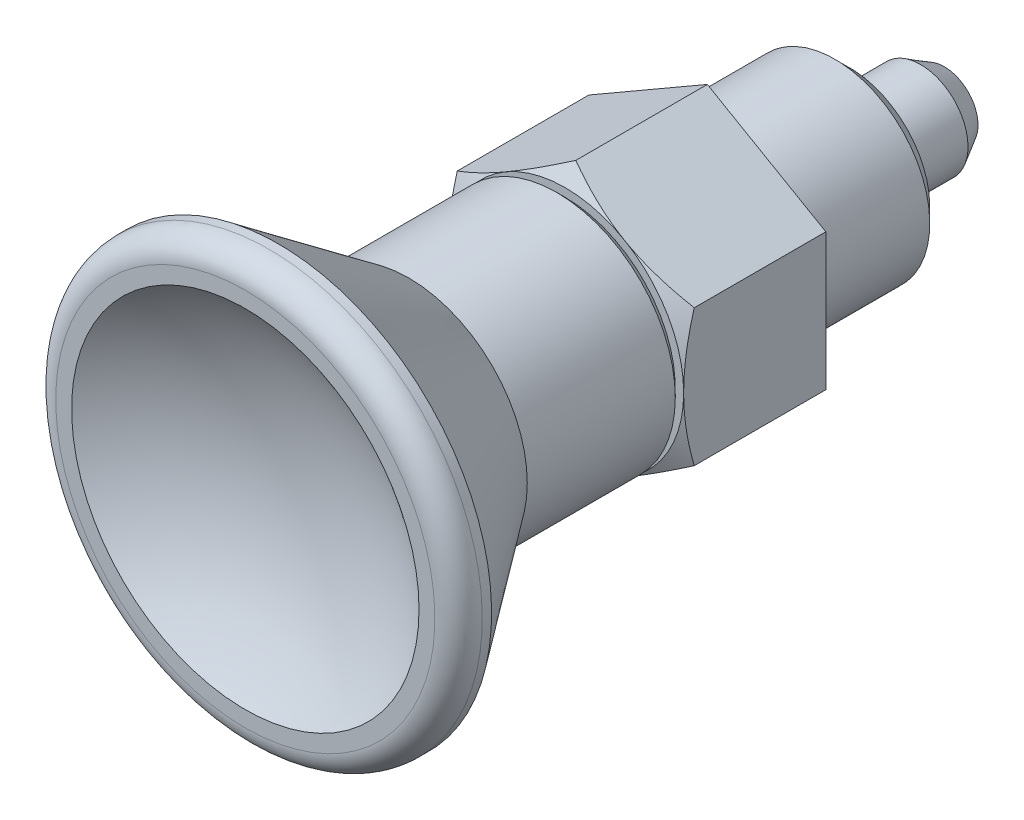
ISO-10303-21;
HEADER;
FILE_DESCRIPTION(('STEP AP214'),'2;1');
FILE_NAME('part.step','',(''),(''),'','','');
FILE_SCHEMA(('AUTOMOTIVE_DESIGN { 1 0 10303 214 1 1 1 1 }'));
ENDSEC;
DATA;
#1=APPLICATION_CONTEXT('core data for automotive mechanical design processes');
#2=APPLICATION_PROTOCOL_DEFINITION('international standard','automotive_design',2000,#1);
#3=PRODUCT_CONTEXT('',#1,'mechanical');
#4=PRODUCT('Part','Part','',(#3));
#5=PRODUCT_RELATED_PRODUCT_CATEGORY('part','',(#4));
#6=PRODUCT_DEFINITION_FORMATION('','',#4);
#7=PRODUCT_DEFINITION_CONTEXT('part definition',#1,'design');
#8=PRODUCT_DEFINITION('design','',#6,#7);
#9=PRODUCT_DEFINITION_SHAPE('','',#8);
#10=(LENGTH_UNIT() NAMED_UNIT(*) SI_UNIT(.MILLI.,.METRE.));
#11=(NAMED_UNIT(*) PLANE_ANGLE_UNIT() SI_UNIT($,.RADIAN.));
#12=(NAMED_UNIT(*) SI_UNIT($,.STERADIAN.) SOLID_ANGLE_UNIT());
#13=UNCERTAINTY_MEASURE_WITH_UNIT(LENGTH_MEASURE(1.E-05),#10,'distance_accuracy_value','');
#14=(GEOMETRIC_REPRESENTATION_CONTEXT(3) GLOBAL_UNCERTAINTY_ASSIGNED_CONTEXT((#13)) GLOBAL_UNIT_ASSIGNED_CONTEXT((#10,
#11,#12)) REPRESENTATION_CONTEXT('',''));
#15=CARTESIAN_POINT('',(0.,0.,0.));
#16=DIRECTION('',(0.,0.,1.));
#17=DIRECTION('',(1.,0.,0.));
#18=AXIS2_PLACEMENT_3D('',#15,#16,#17);
#19=CARTESIAN_POINT('',(1.42264973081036,-1.43972574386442,-10.));
#20=DIRECTION('',(0.,0.,-1.));
#21=DIRECTION('',(0.,1.,0.));
#22=AXIS2_PLACEMENT_3D('',#19,#20,#21);
#23=PLANE('',#22);
#24=CARTESIAN_POINT('',(0.,0.,-9.99999999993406));
#25=DIRECTION('',(0.,0.,1.));
#26=DIRECTION('',(0.,-1.,0.));
#27=AXIS2_PLACEMENT_3D('',#24,#25,#26);
#28=CIRCLE('',#27,1.42264973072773);
#29=CARTESIAN_POINT('',(0.,-1.4226497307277,-9.99999999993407));
#30=VERTEX_POINT('',#29);
#31=EDGE_CURVE('E18',#30,#30,#28,.T.);
#32=ORIENTED_EDGE('',*,*,#31,.F.);
#33=EDGE_LOOP('',(#32));
#34=FACE_BOUND('',#33,.T.);
#35=ADVANCED_FACE('F14',(#34),#23,.T.);
#36=CARTESIAN_POINT('',(0.,0.,-8.99999999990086));
#37=DIRECTION('',(0.,0.,1.));
#38=DIRECTION('',(0.,-1.,0.));
#39=AXIS2_PLACEMENT_3D('',#36,#37,#38);
#40=CONICAL_SURFACE('',#39,1.99999999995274,0.523598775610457);
#41=ORIENTED_EDGE('',*,*,#31,.T.);
#42=EDGE_LOOP('',(#41));
#43=FACE_BOUND('',#42,.T.);
#44=CARTESIAN_POINT('',(0.,0.,-9.));
#45=DIRECTION('',(0.,0.,1.));
#46=DIRECTION('',(0.,-1.,0.));
#47=AXIS2_PLACEMENT_3D('',#44,#45,#46);
#48=CIRCLE('',#47,2.);
#49=CARTESIAN_POINT('',(0.,-1.99999999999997,-9.00000000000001));
#50=VERTEX_POINT('',#49);
#51=EDGE_CURVE('E135',#50,#50,#48,.T.);
#52=ORIENTED_EDGE('',*,*,#51,.F.);
#53=EDGE_LOOP('',(#52));
#54=FACE_BOUND('',#53,.T.);
#55=ADVANCED_FACE('F214',(#43,#54),#40,.T.);
#56=CARTESIAN_POINT('',(0.,0.,-6.));
#57=DIRECTION('',(0.,0.,1.));
#58=DIRECTION('',(0.,-1.,0.));
#59=AXIS2_PLACEMENT_3D('',#56,#57,#58);
#60=CYLINDRICAL_SURFACE('',#59,2.);
#61=ORIENTED_EDGE('',*,*,#51,.T.);
#62=EDGE_LOOP('',(#61));
#63=FACE_BOUND('',#62,.T.);
#64=CARTESIAN_POINT('',(0.,0.,-6.));
#65=DIRECTION('',(0.,0.,1.));
#66=DIRECTION('',(0.,-1.,0.));
#67=AXIS2_PLACEMENT_3D('',#64,#65,#66);
#68=CIRCLE('',#67,2.);
#69=CARTESIAN_POINT('',(0.,-1.99999999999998,-6.00000000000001));
#70=VERTEX_POINT('',#69);
#71=EDGE_CURVE('E137',#70,#70,#68,.T.);
#72=ORIENTED_EDGE('',*,*,#71,.F.);
#73=EDGE_LOOP('',(#72));
#74=FACE_BOUND('',#73,.T.);
#75=ADVANCED_FACE('F212',(#63,#74),#60,.T.);
#76=CARTESIAN_POINT('',(3.3865,-3.42714010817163,-6.));
#77=DIRECTION('',(0.,0.,-1.));
#78=DIRECTION('',(0.,1.,0.));
#79=AXIS2_PLACEMENT_3D('',#76,#77,#78);
#80=PLANE('',#79);
#81=CARTESIAN_POINT('',(0.,0.,-5.99999999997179));
#82=DIRECTION('',(0.,0.,1.));
#83=DIRECTION('',(0.,-1.,0.));
#84=AXIS2_PLACEMENT_3D('',#81,#82,#83);
#85=CIRCLE('',#84,3.38649999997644);
#86=CARTESIAN_POINT('',(0.,-3.38649999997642,-5.9999999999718));
#87=VERTEX_POINT('',#86);
#88=EDGE_CURVE('E134',#87,#87,#85,.T.);
#89=ORIENTED_EDGE('',*,*,#88,.F.);
#90=EDGE_LOOP('',(#89));
#91=FACE_BOUND('',#90,.T.);
#92=ORIENTED_EDGE('',*,*,#71,.T.);
#93=EDGE_LOOP('',(#92));
#94=FACE_BOUND('',#93,.T.);
#95=ADVANCED_FACE('F210',(#91,#94),#80,.T.);
#96=CARTESIAN_POINT('',(0.,0.,-5.38649999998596));
#97=DIRECTION('',(0.,0.,1.));
#98=DIRECTION('',(0.,-1.,0.));
#99=AXIS2_PLACEMENT_3D('',#96,#97,#98);
#100=CONICAL_SURFACE('',#99,3.99999999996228,0.785398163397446);
#101=ORIENTED_EDGE('',*,*,#88,.T.);
#102=EDGE_LOOP('',(#101));
#103=FACE_BOUND('',#102,.T.);
#104=CARTESIAN_POINT('',(0.,0.,-5.3865));
#105=DIRECTION('',(0.,0.,1.));
#106=DIRECTION('',(0.,-1.,0.));
#107=AXIS2_PLACEMENT_3D('',#104,#105,#106);
#108=CIRCLE('',#107,4.);
#109=CARTESIAN_POINT('',(0.,-3.99999999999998,-5.38650000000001));
#110=VERTEX_POINT('',#109);
#111=EDGE_CURVE('E131',#110,#110,#108,.T.);
#112=ORIENTED_EDGE('',*,*,#111,.F.);
#113=EDGE_LOOP('',(#112));
#114=FACE_BOUND('',#113,.T.);
#115=ADVANCED_FACE('F222',(#103,#114),#100,.T.);
#116=CARTESIAN_POINT('',(0.,0.,0.));
#117=DIRECTION('',(0.,0.,1.));
#118=DIRECTION('',(0.,-1.,0.));
#119=AXIS2_PLACEMENT_3D('',#116,#117,#118);
#120=CYLINDRICAL_SURFACE('',#119,4.);
#121=ORIENTED_EDGE('',*,*,#111,.T.);
#122=EDGE_LOOP('',(#121));
#123=FACE_BOUND('',#122,.T.);
#124=CARTESIAN_POINT('',(0.,0.,0.));
#125=DIRECTION('',(0.,0.,1.));
#126=DIRECTION('',(0.,-1.,0.));
#127=AXIS2_PLACEMENT_3D('',#124,#125,#126);
#128=CIRCLE('',#127,4.);
#129=CARTESIAN_POINT('',(0.,-4.,0.));
#130=VERTEX_POINT('',#129);
#131=EDGE_CURVE('E126',#130,#130,#128,.T.);
#132=ORIENTED_EDGE('',*,*,#131,.F.);
#133=EDGE_LOOP('',(#132));
#134=FACE_BOUND('',#133,.T.);
#135=ADVANCED_FACE('F283',(#123,#134),#120,.T.);
#136=CARTESIAN_POINT('',(5.,-5.84278472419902,0.));
#137=DIRECTION('',(0.,0.,-1.));
#138=DIRECTION('',(0.,1.,0.));
#139=AXIS2_PLACEMENT_3D('',#136,#137,#138);
#140=PLANE('',#139);
#141=DIRECTION('',(0.866025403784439,0.5,0.));
#142=VECTOR('',#141,1.);
#143=CARTESIAN_POINT('',(5.,-2.88675134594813,0.));
#144=LINE('',#143,#142);
#145=CARTESIAN_POINT('',(0.,-5.77350269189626,0.));
#146=VERTEX_POINT('',#145);
#147=CARTESIAN_POINT('',(5.,-2.88675134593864,0.));
#148=VERTEX_POINT('',#147);
#149=EDGE_CURVE('E102',#146,#148,#144,.T.);
#150=ORIENTED_EDGE('',*,*,#149,.F.);
#151=DIRECTION('',(0.866025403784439,-0.5,0.));
#152=VECTOR('',#151,1.);
#153=CARTESIAN_POINT('',(0.,-5.77350269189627,0.));
#154=LINE('',#153,#152);
#155=CARTESIAN_POINT('',(-5.,-2.88675134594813,0.));
#156=VERTEX_POINT('',#155);
#157=EDGE_CURVE('E98',#156,#146,#154,.T.);
#158=ORIENTED_EDGE('',*,*,#157,.F.);
#159=DIRECTION('',(0.,1.,0.));
#160=VECTOR('',#159,1.);
#161=CARTESIAN_POINT('',(-5.,-2.88675134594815,0.));
#162=LINE('',#161,#160);
#163=CARTESIAN_POINT('',(-5.,2.88675134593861,0.));
#164=VERTEX_POINT('',#163);
#165=EDGE_CURVE('E90',#164,#156,#162,.F.);
#166=ORIENTED_EDGE('',*,*,#165,.F.);
#167=DIRECTION('',(-0.866025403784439,-0.5,0.));
#168=VECTOR('',#167,1.);
#169=CARTESIAN_POINT('',(-5.,2.88675134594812,0.));
#170=LINE('',#169,#168);
#171=CARTESIAN_POINT('',(-7.91160872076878E-12,5.77350269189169,0.));
#172=VERTEX_POINT('',#171);
#173=EDGE_CURVE('E114',#172,#164,#170,.T.);
#174=ORIENTED_EDGE('',*,*,#173,.F.);
#175=DIRECTION('',(-0.866025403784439,0.5,0.));
#176=VECTOR('',#175,1.);
#177=CARTESIAN_POINT('',(0.,5.77350269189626,0.));
#178=LINE('',#177,#176);
#179=CARTESIAN_POINT('',(5.,2.88675134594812,0.));
#180=VERTEX_POINT('',#179);
#181=EDGE_CURVE('E118',#180,#172,#178,.T.);
#182=ORIENTED_EDGE('',*,*,#181,.F.);
#183=DIRECTION('',(0.,1.,0.));
#184=VECTOR('',#183,1.);
#185=CARTESIAN_POINT('',(5.,2.88675134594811,0.));
#186=LINE('',#185,#184);
#187=EDGE_CURVE('E122',#148,#180,#186,.T.);
#188=ORIENTED_EDGE('',*,*,#187,.F.);
#189=EDGE_LOOP('',(#150,#158,#166,#174,#182,#188));
#190=FACE_BOUND('',#189,.T.);
#191=ORIENTED_EDGE('',*,*,#131,.T.);
#192=EDGE_LOOP('',(#191));
#193=FACE_BOUND('',#192,.T.);
#194=ADVANCED_FACE('F99',(#190,#193),#140,.T.);
#195=CARTESIAN_POINT('',(5.,-2.88675134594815,6.036));
#196=DIRECTION('',(0.5,-0.866025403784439,0.));
#197=DIRECTION('',(0.866025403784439,0.5,0.));
#198=AXIS2_PLACEMENT_3D('',#195,#196,#197);
#199=PLANE('',#198);
#200=DIRECTION('',(0.,0.,-1.));
#201=VECTOR('',#200,1.);
#202=CARTESIAN_POINT('',(5.,-2.8867513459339,6.036));
#203=LINE('',#202,#201);
#204=CARTESIAN_POINT('',(5.,-2.88675136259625,5.55341800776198));
#205=VERTEX_POINT('',#204);
#206=EDGE_CURVE('E123',#205,#148,#203,.T.);
#207=ORIENTED_EDGE('',*,*,#206,.F.);
#208=CARTESIAN_POINT('',(2.50000000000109,-4.33012701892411,5.99999999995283));
#209=CARTESIAN_POINT('',(2.60611097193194,-4.26886382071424,6.00002043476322));
#210=CARTESIAN_POINT('',(2.71221683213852,-4.20760357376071,5.99740020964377));
#211=CARTESIAN_POINT('',(2.92422021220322,-4.08520336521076,5.98703032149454));
#212=CARTESIAN_POINT('',(3.03011776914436,-4.02406338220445,5.97928167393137));
#213=CARTESIAN_POINT('',(3.24102052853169,-3.90229861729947,5.9588578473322));
#214=CARTESIAN_POINT('',(3.34602754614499,-3.84167278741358,5.9462074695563));
#215=CARTESIAN_POINT('',(3.55554129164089,-3.72070997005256,5.91625229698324));
#216=CARTESIAN_POINT('',(3.66004800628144,-3.66037299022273,5.89894737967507));
#217=CARTESIAN_POINT('',(3.9723845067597,-3.48004542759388,5.84058541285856));
#218=CARTESIAN_POINT('',(4.17930694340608,-3.36057870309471,5.79305280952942));
#219=CARTESIAN_POINT('',(4.59137237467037,-3.12267261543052,5.68343046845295));
#220=CARTESIAN_POINT('',(4.7965009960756,-3.00424155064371,5.62126802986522));
#221=CARTESIAN_POINT('',(4.99999992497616,-2.88675138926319,5.55341803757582));
#222=B_SPLINE_CURVE_WITH_KNOTS('',3,(#208,#209,#210,#211,#212,#213,#214,#215,#216,#217,#218,
#219,#220,#221),.UNSPECIFIED.,.F.,.F.,(4,2,2,2,2,2,4),(0.,0.367541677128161,0.735010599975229,
1.10064402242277,1.46628706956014,2.19661482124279,2.93065145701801),.UNSPECIFIED.);
#223=CARTESIAN_POINT('',(2.49999999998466,-4.33012701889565,5.99999999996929));
#224=VERTEX_POINT('',#223);
#225=EDGE_CURVE('E548',#224,#205,#222,.T.);
#226=ORIENTED_EDGE('',*,*,#225,.F.);
#227=CARTESIAN_POINT('',(-4.1939329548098E-08,-5.77350267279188,5.55341798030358));
#228=CARTESIAN_POINT('',(0.203498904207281,-5.6560125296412,5.62126799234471));
#229=CARTESIAN_POINT('',(0.408627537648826,-5.53758146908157,5.68343044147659));
#230=CARTESIAN_POINT('',(0.820692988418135,-5.29967537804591,5.79305279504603));
#231=CARTESIAN_POINT('',(1.02761543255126,-5.18020864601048,5.84058540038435));
#232=CARTESIAN_POINT('',(1.33995194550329,-4.99988107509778,5.89894737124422));
#233=CARTESIAN_POINT('',(1.44445866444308,-4.93954409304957,5.91625229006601));
#234=CARTESIAN_POINT('',(1.65397241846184,-4.81858127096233,5.94620746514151));
#235=CARTESIAN_POINT('',(1.75897944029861,-4.75795543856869,5.95885784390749));
#236=CARTESIAN_POINT('',(1.96988220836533,-4.63619066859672,5.97928167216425));
#237=CARTESIAN_POINT('',(2.07577976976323,-4.57505068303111,5.98703032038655));
#238=CARTESIAN_POINT('',(2.28778315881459,-4.45265046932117,5.99740020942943));
#239=CARTESIAN_POINT('',(2.39388902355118,-4.3913902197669,6.00002043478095));
#240=CARTESIAN_POINT('',(2.50000000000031,-4.33012701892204,5.99999999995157));
#241=B_SPLINE_CURVE_WITH_KNOTS('',3,(#227,#228,#229,#230,#231,#232,#233,#234,#235,#236,#237,
#238,#239,#240),.UNSPECIFIED.,.F.,.F.,(4,2,2,2,2,2,4),(0.,0.734036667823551,1.4643644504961,
1.83000751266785,2.19564095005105,2.56310988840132,2.93065158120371),.UNSPECIFIED.);
#242=CARTESIAN_POINT('',(-1.44249679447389E-08,-5.77350270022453,5.55341800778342));
#243=VERTEX_POINT('',#242);
#244=EDGE_CURVE('E197',#243,#224,#241,.T.);
#245=ORIENTED_EDGE('',*,*,#244,.F.);
#246=DIRECTION('',(0.,0.,1.));
#247=VECTOR('',#246,1.);
#248=CARTESIAN_POINT('',(0.,-5.77350269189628,6.036));
#249=LINE('',#248,#247);
#250=EDGE_CURVE('E104',#146,#243,#249,.T.);
#251=ORIENTED_EDGE('',*,*,#250,.F.);
#252=ORIENTED_EDGE('',*,*,#149,.T.);
#253=EDGE_LOOP('',(#207,#226,#245,#251,#252));
#254=FACE_BOUND('',#253,.T.);
#255=ADVANCED_FACE('F302',(#254),#199,.T.);
#256=CARTESIAN_POINT('',(5.,2.88675134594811,6.036));
#257=DIRECTION('',(1.,0.,0.));
#258=DIRECTION('',(0.,0.,-1.));
#259=AXIS2_PLACEMENT_3D('',#256,#257,#258);
#260=PLANE('',#259);
#261=DIRECTION('',(0.,0.,1.));
#262=VECTOR('',#261,1.);
#263=CARTESIAN_POINT('',(5.,2.88675134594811,6.036));
#264=LINE('',#263,#262);
#265=CARTESIAN_POINT('',(4.9999999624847,2.88675136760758,5.55341802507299));
#266=VERTEX_POINT('',#265);
#267=EDGE_CURVE('E119',#266,#180,#264,.F.);
#268=ORIENTED_EDGE('',*,*,#267,.F.);
#269=CARTESIAN_POINT('',(4.99999999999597,0.,5.99999999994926));
#270=CARTESIAN_POINT('',(4.99999999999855,0.122526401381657,6.0000204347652));
#271=CARTESIAN_POINT('',(4.99999999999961,0.24504690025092,5.99740020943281));
#272=CARTESIAN_POINT('',(5.00000000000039,0.489847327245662,5.98703032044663));
#273=CARTESIAN_POINT('',(5.0000000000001,0.612127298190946,5.97928167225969));
#274=CARTESIAN_POINT('',(4.9999999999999,0.855656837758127,5.95885784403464));
#275=CARTESIAN_POINT('',(4.99999999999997,0.976908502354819,5.94620746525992));
#276=CARTESIAN_POINT('',(5.00000000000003,1.21883414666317,5.91625229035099));
#277=CARTESIAN_POINT('',(5.00000000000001,1.33950811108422,5.89894737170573));
#278=CARTESIAN_POINT('',(4.99999999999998,1.70016325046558,5.8405854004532));
#279=CARTESIAN_POINT('',(4.99999999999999,1.93909670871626,5.79305279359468));
#280=CARTESIAN_POINT('',(5.00000000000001,2.41490890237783,5.68343044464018));
#281=CARTESIAN_POINT('',(5.00000000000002,2.65177104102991,5.62126800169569));
#282=CARTESIAN_POINT('',(5.,2.88675137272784,5.55341800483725));
#283=B_SPLINE_CURVE_WITH_KNOTS('',3,(#269,#270,#271,#272,#273,#274,#275,#276,#277,#278,#279,
#280,#281,#282),.UNSPECIFIED.,.F.,.F.,(4,2,2,2,2,2,4),(0.,0.367541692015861,0.73501062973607,
1.10064406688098,1.46628712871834,2.19661490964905,2.93065157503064),.UNSPECIFIED.);
#284=CARTESIAN_POINT('',(4.99999999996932,0.,5.99999999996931));
#285=VERTEX_POINT('',#284);
#286=EDGE_CURVE('E529',#285,#266,#283,.T.);
#287=ORIENTED_EDGE('',*,*,#286,.F.);
#288=CARTESIAN_POINT('',(4.99999996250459,-2.88675137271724,5.55341798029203));
#289=CARTESIAN_POINT('',(4.99999998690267,-2.65177104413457,5.62126799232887));
#290=CARTESIAN_POINT('',(4.99999999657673,-2.4149089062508,5.68343044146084));
#291=CARTESIAN_POINT('',(5.00000000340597,-1.9390967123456,5.79305279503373));
#292=CARTESIAN_POINT('',(5.00000000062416,-1.70016325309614,5.84058540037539));
#293=CARTESIAN_POINT('',(4.99999999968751,-1.33950811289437,5.89894737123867));
#294=CARTESIAN_POINT('',(4.99999999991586,-1.21883414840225,5.91625229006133));
#295=CARTESIAN_POINT('',(5.00000000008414,-0.976908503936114,5.94620746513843));
#296=CARTESIAN_POINT('',(5.00000000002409,-0.855656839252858,5.95885784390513));
#297=CARTESIAN_POINT('',(4.99999999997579,-0.612127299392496,5.97928167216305));
#298=CARTESIAN_POINT('',(4.99999999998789,-0.489847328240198,5.98703032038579));
#299=CARTESIAN_POINT('',(5.00000000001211,-0.245046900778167,5.99740020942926));
#300=CARTESIAN_POINT('',(5.00000000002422,-0.122526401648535,6.00002043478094));
#301=CARTESIAN_POINT('',(5.,-6.92524787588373E-13,5.99999999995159));
#302=B_SPLINE_CURVE_WITH_KNOTS('',3,(#288,#289,#290,#291,#292,#293,#294,#295,#296,#297,#298,
#299,#300,#301),.UNSPECIFIED.,.F.,.F.,(4,2,2,2,2,2,4),(0.,0.73403666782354,1.46436445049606,
1.83000751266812,2.19564095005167,2.56310988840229,2.93065158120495),.UNSPECIFIED.);
#303=EDGE_CURVE('E542',#205,#285,#302,.T.);
#304=ORIENTED_EDGE('',*,*,#303,.F.);
#305=ORIENTED_EDGE('',*,*,#206,.T.);
#306=ORIENTED_EDGE('',*,*,#187,.T.);
#307=EDGE_LOOP('',(#268,#287,#304,#305,#306));
#308=FACE_BOUND('',#307,.T.);
#309=ADVANCED_FACE('F311',(#308),#260,.T.);
#310=CARTESIAN_POINT('',(0.,5.77350269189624,6.036));
#311=DIRECTION('',(0.5,0.866025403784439,0.));
#312=DIRECTION('',(-0.866025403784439,0.5,0.));
#313=AXIS2_PLACEMENT_3D('',#310,#311,#312);
#314=PLANE('',#313);
#315=DIRECTION('',(0.,0.,1.));
#316=VECTOR('',#315,1.);
#317=CARTESIAN_POINT('',(-1.18594370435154E-11,5.77350269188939,6.036));
#318=LINE('',#317,#316);
#319=CARTESIAN_POINT('',(-8.89263131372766E-12,5.77350269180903,5.5534180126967));
#320=VERTEX_POINT('',#319);
#321=EDGE_CURVE('E115',#320,#172,#318,.F.);
#322=ORIENTED_EDGE('',*,*,#321,.F.);
#323=CARTESIAN_POINT('',(2.5000000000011,4.33012701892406,5.99999999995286));
#324=CARTESIAN_POINT('',(2.39388902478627,4.3913902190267,6.00002043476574));
#325=CARTESIAN_POINT('',(2.2877831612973,4.452650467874,5.99740020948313));
#326=CARTESIAN_POINT('',(2.07577977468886,4.575050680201,5.98703032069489));
#327=CARTESIAN_POINT('',(1.96988221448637,4.63619066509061,5.97928167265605));
#328=CARTESIAN_POINT('',(1.75897944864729,4.75795543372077,5.95885784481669));
#329=CARTESIAN_POINT('',(1.65397242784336,4.81858126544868,5.94620746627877));
#330=CARTESIAN_POINT('',(1.44445867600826,4.93954408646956,5.91625229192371));
#331=CARTESIAN_POINT('',(1.33995195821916,4.99988106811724,5.89894737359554));
#332=CARTESIAN_POINT('',(1.02761544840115,5.18020863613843,5.84058540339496));
#333=CARTESIAN_POINT('',(0.820693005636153,5.29967536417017,5.79305279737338));
#334=CARTESIAN_POINT('',(0.408627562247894,5.53758145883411,5.68343045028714));
#335=CARTESIAN_POINT('',(0.203498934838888,5.65601252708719,5.6212680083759));
#336=CARTESIAN_POINT('',(2.80552871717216E-11,5.77350269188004,5.55341801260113));
#337=B_SPLINE_CURVE_WITH_KNOTS('',3,(#323,#324,#325,#326,#327,#328,#329,#330,#331,#332,#333,
#334,#335,#336),.UNSPECIFIED.,.F.,.F.,(4,2,2,2,2,2,4),(0.,0.367541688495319,0.735010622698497,
1.10064405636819,1.46628711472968,2.19661488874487,2.93065154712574),.UNSPECIFIED.);
#338=CARTESIAN_POINT('',(2.49999999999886,4.33012701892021,5.99999999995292));
#339=VERTEX_POINT('',#338);
#340=EDGE_CURVE('E518',#339,#320,#337,.T.);
#341=ORIENTED_EDGE('',*,*,#340,.F.);
#342=CARTESIAN_POINT('',(4.9999999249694,2.88675138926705,5.55341803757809));
#343=CARTESIAN_POINT('',(4.79650099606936,3.00424155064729,5.62126802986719));
#344=CARTESIAN_POINT('',(4.59137237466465,3.12267261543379,5.68343046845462));
#345=CARTESIAN_POINT('',(4.17930694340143,3.36057870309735,5.79305280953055));
#346=CARTESIAN_POINT('',(3.9723845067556,3.4800454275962,5.84058541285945));
#347=CARTESIAN_POINT('',(3.66004800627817,3.66037299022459,5.89894737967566));
#348=CARTESIAN_POINT('',(3.55554129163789,3.72070997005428,5.91625229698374));
#349=CARTESIAN_POINT('',(3.34602754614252,3.84167278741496,5.94620746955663));
#350=CARTESIAN_POINT('',(3.24102052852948,3.90229861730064,5.95885784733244));
#351=CARTESIAN_POINT('',(3.03011776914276,4.0240633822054,5.97928167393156));
#352=CARTESIAN_POINT('',(2.92422021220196,4.08520336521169,5.98703032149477));
#353=CARTESIAN_POINT('',(2.71221683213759,4.20760357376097,5.9974002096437));
#354=CARTESIAN_POINT('',(2.60611097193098,4.26886382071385,6.00002043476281));
#355=CARTESIAN_POINT('',(2.49999999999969,4.33012701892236,5.99999999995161));
#356=B_SPLINE_CURVE_WITH_KNOTS('',3,(#342,#343,#344,#345,#346,#347,#348,#349,#350,#351,#352,
#353,#354,#355),.UNSPECIFIED.,.F.,.F.,(4,2,2,2,2,2,4),(0.,0.734036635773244,1.46436438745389,
1.8300074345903,2.19564085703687,2.56310977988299,2.93065145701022),.UNSPECIFIED.);
#357=EDGE_CURVE('E535',#266,#339,#356,.T.);
#358=ORIENTED_EDGE('',*,*,#357,.F.);
#359=ORIENTED_EDGE('',*,*,#267,.T.);
#360=ORIENTED_EDGE('',*,*,#181,.T.);
#361=EDGE_LOOP('',(#322,#341,#358,#359,#360));
#362=FACE_BOUND('',#361,.T.);
#363=ADVANCED_FACE('F320',(#362),#314,.T.);
#364=CARTESIAN_POINT('',(-5.,2.88675134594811,6.036));
#365=DIRECTION('',(-0.5,0.866025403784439,0.));
#366=DIRECTION('',(-0.866025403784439,-0.5,0.));
#367=AXIS2_PLACEMENT_3D('',#364,#365,#366);
#368=PLANE('',#367);
#369=DIRECTION('',(0.,0.,1.));
#370=VECTOR('',#369,1.);
#371=CARTESIAN_POINT('',(-5.,2.88675134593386,6.036));
#372=LINE('',#371,#370);
#373=CARTESIAN_POINT('',(-5.,2.88675130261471,5.55341802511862));
#374=VERTEX_POINT('',#373);
#375=EDGE_CURVE('E93',#374,#164,#372,.F.);
#376=ORIENTED_EDGE('',*,*,#375,.F.);
#377=CARTESIAN_POINT('',(-2.5,4.33012701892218,5.99999999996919));
#378=CARTESIAN_POINT('',(-2.60611097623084,4.26886381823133,6.00002043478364));
#379=CARTESIAN_POINT('',(-2.712216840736,4.20760356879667,5.99740020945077));
#380=CARTESIAN_POINT('',(-2.92422022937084,4.08520335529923,5.98703032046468));
#381=CARTESIAN_POINT('',(-3.03011779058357,4.02406336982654,5.97928167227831));
#382=CARTESIAN_POINT('',(-3.24102055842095,3.90229860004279,5.95885784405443));
#383=CARTESIAN_POINT('',(-3.34602758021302,3.84167276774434,5.94620746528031));
#384=CARTESIAN_POINT('',(-3.55554133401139,3.72070994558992,5.91625229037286));
#385=CARTESIAN_POINT('',(-3.66004805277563,3.66037296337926,5.89894737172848));
#386=CARTESIAN_POINT('',(-3.97238456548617,3.48004539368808,5.84058540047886));
#387=CARTESIAN_POINT('',(-4.17930701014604,3.36057866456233,5.79305279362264));
#388=CARTESIAN_POINT('',(-4.59137245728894,3.12267256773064,5.68343044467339));
#389=CARTESIAN_POINT('',(-4.79650108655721,3.0042414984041,5.62126800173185));
#390=CARTESIAN_POINT('',(-5.00000002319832,2.88675133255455,5.55341800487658));
#391=B_SPLINE_CURVE_WITH_KNOTS('',3,(#377,#378,#379,#380,#381,#382,#383,#384,#385,#386,#387,
#388,#389,#390),.UNSPECIFIED.,.F.,.F.,(4,2,2,2,2,2,4),(0.,0.367541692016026,0.735010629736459,
1.10064406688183,1.46628712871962,2.19661490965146,2.93065157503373),.UNSPECIFIED.);
#392=CARTESIAN_POINT('',(-2.49999999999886,4.33012701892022,5.9999999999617));
#393=VERTEX_POINT('',#392);
#394=EDGE_CURVE('E495',#393,#374,#391,.T.);
#395=ORIENTED_EDGE('',*,*,#394,.F.);
#396=CARTESIAN_POINT('',(-2.69955803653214E-11,5.77350269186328,5.55341801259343));
#397=CARTESIAN_POINT('',(-0.203498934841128,5.65601252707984,5.621268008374));
#398=CARTESIAN_POINT('',(-0.408627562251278,5.53758145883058,5.68343045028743));
#399=CARTESIAN_POINT('',(-0.820693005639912,5.29967536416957,5.79305279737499));
#400=CARTESIAN_POINT('',(-1.02761544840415,5.18020863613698,5.84058540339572));
#401=CARTESIAN_POINT('',(-1.33995195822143,4.99988106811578,5.89894737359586));
#402=CARTESIAN_POINT('',(-1.44445867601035,4.93954408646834,5.91625229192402));
#403=CARTESIAN_POINT('',(-1.65397242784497,4.81858126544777,5.94620746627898));
#404=CARTESIAN_POINT('',(-1.75897944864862,4.75795543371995,5.95885784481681));
#405=CARTESIAN_POINT('',(-1.9698822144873,4.63619066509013,5.97928167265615));
#406=CARTESIAN_POINT('',(-2.07577977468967,4.57505068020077,5.98703032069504));
#407=CARTESIAN_POINT('',(-2.28778316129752,4.45265046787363,5.99740020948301));
#408=CARTESIAN_POINT('',(-2.39388902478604,4.39139021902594,6.00002043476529));
#409=CARTESIAN_POINT('',(-2.5,4.33012701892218,5.9999999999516));
#410=B_SPLINE_CURVE_WITH_KNOTS('',3,(#396,#397,#398,#399,#400,#401,#402,#403,#404,#405,#406,
#407,#408,#409),.UNSPECIFIED.,.F.,.F.,(4,2,2,2,2,2,4),(0.,0.734036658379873,1.46436443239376,
1.83000749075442,2.19564092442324,2.56310985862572,2.93065154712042),.UNSPECIFIED.);
#411=EDGE_CURVE('E497',#320,#393,#410,.T.);
#412=ORIENTED_EDGE('',*,*,#411,.F.);
#413=ORIENTED_EDGE('',*,*,#321,.T.);
#414=ORIENTED_EDGE('',*,*,#173,.T.);
#415=EDGE_LOOP('',(#376,#395,#412,#413,#414));
#416=FACE_BOUND('',#415,.T.);
#417=ADVANCED_FACE('F330',(#416),#368,.T.);
#418=CARTESIAN_POINT('',(-5.,-2.88675134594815,6.036));
#419=DIRECTION('',(-1.,0.,0.));
#420=DIRECTION('',(0.,0.,1.));
#421=AXIS2_PLACEMENT_3D('',#418,#419,#420);
#422=PLANE('',#421);
#423=DIRECTION('',(0.,0.,1.));
#424=VECTOR('',#423,1.);
#425=CARTESIAN_POINT('',(-5.,-2.88675134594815,6.036));
#426=LINE('',#425,#424);
#427=CARTESIAN_POINT('',(-5.00000001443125,-2.88675133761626,5.55341800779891));
#428=VERTEX_POINT('',#427);
#429=EDGE_CURVE('E69',#428,#156,#426,.F.);
#430=ORIENTED_EDGE('',*,*,#429,.F.);
#431=CARTESIAN_POINT('',(-5.,0.,5.99999999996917));
#432=CARTESIAN_POINT('',(-5.,-0.122526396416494,6.00002043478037));
#433=CARTESIAN_POINT('',(-5.,-0.245046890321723,5.99740020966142));
#434=CARTESIAN_POINT('',(-5.,-0.489847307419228,5.98703032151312));
#435=CARTESIAN_POINT('',(-5.,-0.612127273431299,5.97928167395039));
#436=CARTESIAN_POINT('',(-5.,-0.855656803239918,5.9588578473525));
#437=CARTESIAN_POINT('',(-5.,-0.976908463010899,5.94620746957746));
#438=CARTESIAN_POINT('',(-5.,-1.21883409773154,5.91625229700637));
#439=CARTESIAN_POINT('',(-5.,-1.33950805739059,5.89894737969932));
#440=CARTESIAN_POINT('',(-5.,-1.70016318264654,5.84058541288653));
#441=CARTESIAN_POINT('',(-5.,-1.93909663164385,5.79305280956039));
#442=CARTESIAN_POINT('',(-5.,-2.41490880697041,5.68343046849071));
#443=CARTESIAN_POINT('',(-5.,-2.65177093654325,5.62126802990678));
#444=CARTESIAN_POINT('',(-5.,-2.88675125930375,5.55341803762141));
#445=B_SPLINE_CURVE_WITH_KNOTS('',3,(#431,#432,#433,#434,#435,#436,#437,#438,#439,#440,#441,
#442,#443,#444),.UNSPECIFIED.,.F.,.F.,(4,2,2,2,2,2,4),(0.,0.367541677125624,0.73501059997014,
1.10064402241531,1.46628706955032,2.19661482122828,2.93065145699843),.UNSPECIFIED.);
#446=CARTESIAN_POINT('',(-4.99999999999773,0.,5.99999999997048));
#447=VERTEX_POINT('',#446);
#448=EDGE_CURVE('E33',#447,#428,#445,.T.);
#449=ORIENTED_EDGE('',*,*,#448,.F.);
#450=CARTESIAN_POINT('',(-5.,2.88675125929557,5.55341803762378));
#451=CARTESIAN_POINT('',(-5.,2.65177093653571,5.62126802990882));
#452=CARTESIAN_POINT('',(-5.,2.41490880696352,5.68343046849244));
#453=CARTESIAN_POINT('',(-5.,1.93909663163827,5.79305280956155));
#454=CARTESIAN_POINT('',(-5.,1.70016318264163,5.84058541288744));
#455=CARTESIAN_POINT('',(-5.,1.33950805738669,5.8989473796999));
#456=CARTESIAN_POINT('',(-5.,1.21883409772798,5.91625229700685));
#457=CARTESIAN_POINT('',(-5.,0.976908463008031,5.94620746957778));
#458=CARTESIAN_POINT('',(-5.,0.855656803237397,5.95885784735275));
#459=CARTESIAN_POINT('',(-5.,0.612127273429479,5.97928167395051));
#460=CARTESIAN_POINT('',(-5.,0.489847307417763,5.9870303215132));
#461=CARTESIAN_POINT('',(-5.,0.245046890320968,5.99740020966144));
#462=CARTESIAN_POINT('',(-5.,0.122526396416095,6.00002043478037));
#463=CARTESIAN_POINT('',(-5.,0.,5.99999999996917));
#464=B_SPLINE_CURVE_WITH_KNOTS('',3,(#450,#451,#452,#453,#454,#455,#456,#457,#458,#459,#460,
#461,#462,#463),.UNSPECIFIED.,.F.,.F.,(4,2,2,2,2,2,4),(0.,0.734036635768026,1.46436438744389,
1.83000743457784,2.19564085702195,2.5631097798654,2.93065145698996),.UNSPECIFIED.);
#465=EDGE_CURVE('E496',#374,#447,#464,.T.);
#466=ORIENTED_EDGE('',*,*,#465,.F.);
#467=ORIENTED_EDGE('',*,*,#375,.T.);
#468=ORIENTED_EDGE('',*,*,#165,.T.);
#469=EDGE_LOOP('',(#430,#449,#466,#467,#468));
#470=FACE_BOUND('',#469,.T.);
#471=ADVANCED_FACE('F92',(#470),#422,.T.);
#472=CARTESIAN_POINT('',(0.,-5.77350269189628,6.036));
#473=DIRECTION('',(-0.5,-0.866025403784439,0.));
#474=DIRECTION('',(0.866025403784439,-0.5,0.));
#475=AXIS2_PLACEMENT_3D('',#472,#473,#474);
#476=PLANE('',#475);
#477=ORIENTED_EDGE('',*,*,#250,.T.);
#478=CARTESIAN_POINT('',(-2.5,-4.33012701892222,5.99999999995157));
#479=CARTESIAN_POINT('',(-2.39388902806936,-4.39139021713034,6.00002043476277));
#480=CARTESIAN_POINT('',(-2.28778316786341,-4.45265046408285,5.99740020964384));
#481=CARTESIAN_POINT('',(-2.07577978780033,-4.57505067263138,5.98703032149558));
#482=CARTESIAN_POINT('',(-1.96988223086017,-4.6361906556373,5.97928167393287));
#483=CARTESIAN_POINT('',(-1.7589794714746,-4.75795542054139,5.95885784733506));
#484=CARTESIAN_POINT('',(-1.65397245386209,-4.81858125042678,5.94620746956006));
#485=CARTESIAN_POINT('',(-1.44445870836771,-4.93954406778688,5.91625229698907));
#486=CARTESIAN_POINT('',(-1.3399519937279,-4.9998810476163,5.89894737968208));
#487=CARTESIAN_POINT('',(-1.02761549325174,-5.18020861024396,5.8405854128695));
#488=CARTESIAN_POINT('',(-0.820693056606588,-5.29967533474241,5.79305280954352));
#489=CARTESIAN_POINT('',(-0.40862762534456,-5.53758142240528,5.68343046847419));
#490=CARTESIAN_POINT('',(-0.203499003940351,-5.6560124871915,5.62126802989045));
#491=CARTESIAN_POINT('',(-7.50406408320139E-08,-5.77350264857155,5.55341803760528));
#492=B_SPLINE_CURVE_WITH_KNOTS('',3,(#478,#479,#480,#481,#482,#483,#484,#485,#486,#487,#488,
#489,#490,#491),.UNSPECIFIED.,.F.,.F.,(4,2,2,2,2,2,4),(0.,0.367541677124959,0.73501059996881,
1.10064402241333,1.46628706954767,2.19661482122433,2.93065145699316),.UNSPECIFIED.);
#493=CARTESIAN_POINT('',(-2.5,-4.33012701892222,5.99999999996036));
#494=VERTEX_POINT('',#493);
#495=EDGE_CURVE('E65',#494,#243,#492,.T.);
#496=ORIENTED_EDGE('',*,*,#495,.F.);
#497=CARTESIAN_POINT('',(-5.0000000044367,-2.88675130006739,5.55341798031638));
#498=CARTESIAN_POINT('',(-4.79650108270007,-3.00424148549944,5.62126799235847));
#499=CARTESIAN_POINT('',(-4.59137245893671,-3.12267256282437,5.68343044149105));
#500=CARTESIAN_POINT('',(-4.17930701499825,-3.36057866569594,5.79305279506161));
#501=CARTESIAN_POINT('',(-3.97238456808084,-3.48004539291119,5.84058540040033));
#502=CARTESIAN_POINT('',(-3.66004805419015,-3.66037296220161,5.89894737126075));
#503=CARTESIAN_POINT('',(-3.55554133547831,-3.72070994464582,5.91625229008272));
#504=CARTESIAN_POINT('',(-3.3460275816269,-3.84167276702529,5.94620746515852));
#505=CARTESIAN_POINT('',(-3.24102055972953,-3.90229859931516,5.95885784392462));
#506=CARTESIAN_POINT('',(-3.03011779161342,-4.02406336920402,5.97928167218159));
#507=CARTESIAN_POINT('',(-2.92422023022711,-4.08520335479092,5.98703032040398));
#508=CARTESIAN_POINT('',(-2.71221684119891,-4.20760356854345,5.99740020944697));
#509=CARTESIAN_POINT('',(-2.6061109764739,-4.26886381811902,6.00002043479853));
#510=CARTESIAN_POINT('',(-2.5,-4.33012701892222,5.99999999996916));
#511=B_SPLINE_CURVE_WITH_KNOTS('',3,(#497,#498,#499,#500,#501,#502,#503,#504,#505,#506,#507,
#508,#509,#510),.UNSPECIFIED.,.F.,.F.,(4,2,2,2,2,2,4),(0.,0.734036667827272,1.46436445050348,
1.83000751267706,2.19564095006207,2.5631098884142,2.93065158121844),.UNSPECIFIED.);
#512=EDGE_CURVE('E108',#428,#494,#511,.T.);
#513=ORIENTED_EDGE('',*,*,#512,.F.);
#514=ORIENTED_EDGE('',*,*,#429,.T.);
#515=ORIENTED_EDGE('',*,*,#157,.T.);
#516=EDGE_LOOP('',(#477,#496,#513,#514,#515));
#517=FACE_BOUND('',#516,.T.);
#518=ADVANCED_FACE('F106',(#517),#476,.T.);
#519=CARTESIAN_POINT('',(0.,0.,5.55073852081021));
#520=DIRECTION('',(0.,0.,-1.));
#521=DIRECTION('',(0.,1.,0.));
#522=AXIS2_PLACEMENT_3D('',#519,#520,#521);
#523=CONICAL_SURFACE('',#522,5.77814370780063,1.0471975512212);
#524=ORIENTED_EDGE('',*,*,#495,.T.);
#525=ORIENTED_EDGE('',*,*,#244,.T.);
#526=CARTESIAN_POINT('',(0.,0.,5.9999999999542));
#527=DIRECTION('',(0.,0.,-1.));
#528=DIRECTION('',(0.,1.,0.));
#529=AXIS2_PLACEMENT_3D('',#526,#527,#528);
#530=CIRCLE('',#529,4.99999999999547);
#531=EDGE_CURVE('E161',#494,#224,#530,.F.);
#532=ORIENTED_EDGE('',*,*,#531,.F.);
#533=EDGE_LOOP('',(#524,#525,#532));
#534=FACE_BOUND('',#533,.T.);
#535=ADVANCED_FACE('F184',(#534),#523,.T.);
#536=CARTESIAN_POINT('',(0.,0.,5.55073852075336));
#537=DIRECTION('',(0.,0.,-1.));
#538=DIRECTION('',(0.,1.,0.));
#539=AXIS2_PLACEMENT_3D('',#536,#537,#538);
#540=CONICAL_SURFACE('',#539,5.77814370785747,1.04719755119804);
#541=ORIENTED_EDGE('',*,*,#225,.T.);
#542=ORIENTED_EDGE('',*,*,#303,.T.);
#543=CARTESIAN_POINT('',(0.,0.,5.99999999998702));
#544=DIRECTION('',(0.,0.,-1.));
#545=DIRECTION('',(0.,1.,0.));
#546=AXIS2_PLACEMENT_3D('',#543,#544,#545);
#547=CIRCLE('',#546,4.99999999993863);
#548=EDGE_CURVE('E158',#224,#285,#547,.F.);
#549=ORIENTED_EDGE('',*,*,#548,.F.);
#550=EDGE_LOOP('',(#541,#542,#549));
#551=FACE_BOUND('',#550,.T.);
#552=ADVANCED_FACE('F361',(#551),#540,.T.);
#553=CARTESIAN_POINT('',(0.,0.,5.55073852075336));
#554=DIRECTION('',(0.,0.,-1.));
#555=DIRECTION('',(0.,1.,0.));
#556=AXIS2_PLACEMENT_3D('',#553,#554,#555);
#557=CONICAL_SURFACE('',#556,5.77814370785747,1.04719755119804);
#558=CARTESIAN_POINT('',(0.,0.,5.99999999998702));
#559=DIRECTION('',(0.,0.,-1.));
#560=DIRECTION('',(0.,1.,0.));
#561=AXIS2_PLACEMENT_3D('',#558,#559,#560);
#562=CIRCLE('',#561,4.99999999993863);
#563=EDGE_CURVE('E155',#285,#339,#562,.F.);
#564=ORIENTED_EDGE('',*,*,#563,.F.);
#565=ORIENTED_EDGE('',*,*,#286,.T.);
#566=ORIENTED_EDGE('',*,*,#357,.T.);
#567=EDGE_LOOP('',(#564,#565,#566));
#568=FACE_BOUND('',#567,.T.);
#569=ADVANCED_FACE('F370',(#568),#557,.T.);
#570=CARTESIAN_POINT('',(0.,0.,5.55073852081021));
#571=DIRECTION('',(0.,0.,-1.));
#572=DIRECTION('',(0.,1.,0.));
#573=AXIS2_PLACEMENT_3D('',#570,#571,#572);
#574=CONICAL_SURFACE('',#573,5.77814370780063,1.0471975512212);
#575=CARTESIAN_POINT('',(0.,0.,5.9999999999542));
#576=DIRECTION('',(0.,0.,-1.));
#577=DIRECTION('',(0.,1.,0.));
#578=AXIS2_PLACEMENT_3D('',#575,#576,#577);
#579=CIRCLE('',#578,4.99999999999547);
#580=EDGE_CURVE('E152',#339,#393,#579,.F.);
#581=ORIENTED_EDGE('',*,*,#580,.F.);
#582=ORIENTED_EDGE('',*,*,#340,.T.);
#583=ORIENTED_EDGE('',*,*,#411,.T.);
#584=EDGE_LOOP('',(#581,#582,#583));
#585=FACE_BOUND('',#584,.T.);
#586=ADVANCED_FACE('F379',(#585),#574,.T.);
#587=CARTESIAN_POINT('',(0.,0.,5.55073852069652));
#588=DIRECTION('',(0.,0.,-1.));
#589=DIRECTION('',(0.,1.,0.));
#590=AXIS2_PLACEMENT_3D('',#587,#588,#589);
#591=CONICAL_SURFACE('',#590,5.778143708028,1.0471975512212);
#592=CARTESIAN_POINT('',(0.,0.,5.99999999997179));
#593=DIRECTION('',(0.,0.,-1.));
#594=DIRECTION('',(0.,1.,0.));
#595=AXIS2_PLACEMENT_3D('',#592,#593,#594);
#596=CIRCLE('',#595,4.99999999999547);
#597=EDGE_CURVE('E149',#393,#447,#596,.F.);
#598=ORIENTED_EDGE('',*,*,#597,.F.);
#599=ORIENTED_EDGE('',*,*,#394,.T.);
#600=ORIENTED_EDGE('',*,*,#465,.T.);
#601=EDGE_LOOP('',(#598,#599,#600));
#602=FACE_BOUND('',#601,.T.);
#603=ADVANCED_FACE('F389',(#602),#591,.T.);
#604=CARTESIAN_POINT('',(0.,0.,5.55073852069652));
#605=DIRECTION('',(0.,0.,-1.));
#606=DIRECTION('',(0.,1.,0.));
#607=AXIS2_PLACEMENT_3D('',#604,#605,#606);
#608=CONICAL_SURFACE('',#607,5.778143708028,1.0471975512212);
#609=ORIENTED_EDGE('',*,*,#448,.T.);
#610=ORIENTED_EDGE('',*,*,#512,.T.);
#611=CARTESIAN_POINT('',(0.,0.,5.99999999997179));
#612=DIRECTION('',(0.,0.,-1.));
#613=DIRECTION('',(0.,1.,0.));
#614=AXIS2_PLACEMENT_3D('',#611,#612,#613);
#615=CIRCLE('',#614,4.99999999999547);
#616=EDGE_CURVE('E146',#447,#494,#615,.F.);
#617=ORIENTED_EDGE('',*,*,#616,.F.);
#618=EDGE_LOOP('',(#609,#610,#617));
#619=FACE_BOUND('',#618,.T.);
#620=ADVANCED_FACE('F177',(#619),#608,.T.);
#621=CARTESIAN_POINT('',(-5.,-5.06000330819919,6.));
#622=DIRECTION('',(0.,0.,1.));
#623=DIRECTION('',(0.,-1.,0.));
#624=AXIS2_PLACEMENT_3D('',#621,#622,#623);
#625=PLANE('',#624);
#626=ORIENTED_EDGE('',*,*,#597,.T.);
#627=ORIENTED_EDGE('',*,*,#616,.T.);
#628=ORIENTED_EDGE('',*,*,#531,.T.);
#629=ORIENTED_EDGE('',*,*,#548,.T.);
#630=ORIENTED_EDGE('',*,*,#563,.T.);
#631=ORIENTED_EDGE('',*,*,#580,.T.);
#632=EDGE_LOOP('',(#626,#627,#628,#629,#630,#631));
#633=FACE_BOUND('',#632,.T.);
#634=CARTESIAN_POINT('',(0.,0.,6.00000000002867));
#635=DIRECTION('',(0.,0.,1.));
#636=DIRECTION('',(0.,-1.,0.));
#637=AXIS2_PLACEMENT_3D('',#634,#635,#636);
#638=CIRCLE('',#637,4.64644660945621);
#639=CARTESIAN_POINT('',(0.,-4.64644660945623,6.00000000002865));
#640=VERTEX_POINT('',#639);
#641=EDGE_CURVE('E142',#640,#640,#638,.T.);
#642=ORIENTED_EDGE('',*,*,#641,.F.);
#643=EDGE_LOOP('',(#642));
#644=FACE_BOUND('',#643,.T.);
#645=ADVANCED_FACE('F407',(#633,#644),#625,.T.);
#646=CARTESIAN_POINT('',(0.,0.,6.35355339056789));
#647=DIRECTION('',(0.,0.,1.));
#648=DIRECTION('',(0.,-1.,0.));
#649=AXIS2_PLACEMENT_3D('',#646,#647,#648);
#650=CONICAL_SURFACE('',#649,4.99999999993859,0.785398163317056);
#651=CARTESIAN_POINT('',(0.,0.,6.35355339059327));
#652=DIRECTION('',(0.,0.,1.));
#653=DIRECTION('',(0.,-1.,0.));
#654=AXIS2_PLACEMENT_3D('',#651,#652,#653);
#655=CIRCLE('',#654,5.);
#656=CARTESIAN_POINT('',(0.,-5.00000000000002,6.35355339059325));
#657=VERTEX_POINT('',#656);
#658=EDGE_CURVE('E145',#657,#657,#655,.T.);
#659=ORIENTED_EDGE('',*,*,#658,.F.);
#660=EDGE_LOOP('',(#659));
#661=FACE_BOUND('',#660,.T.);
#662=ORIENTED_EDGE('',*,*,#641,.T.);
#663=EDGE_LOOP('',(#662));
#664=FACE_BOUND('',#663,.T.);
#665=ADVANCED_FACE('F416',(#661,#664),#650,.T.);
#666=CARTESIAN_POINT('',(0.,0.,12.6));
#667=DIRECTION('',(0.,0.,1.));
#668=DIRECTION('',(0.,-1.,0.));
#669=AXIS2_PLACEMENT_3D('',#666,#667,#668);
#670=CYLINDRICAL_SURFACE('',#669,5.);
#671=CARTESIAN_POINT('',(0.,0.,12.6000000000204));
#672=DIRECTION('',(0.,0.,1.));
#673=DIRECTION('',(0.,-1.,0.));
#674=AXIS2_PLACEMENT_3D('',#671,#672,#673);
#675=CIRCLE('',#674,4.99999999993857);
#676=CARTESIAN_POINT('',(0.,-4.99999999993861,12.6000000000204));
#677=VERTEX_POINT('',#676);
#678=EDGE_CURVE('E478',#677,#677,#675,.T.);
#679=ORIENTED_EDGE('',*,*,#678,.F.);
#680=EDGE_LOOP('',(#679));
#681=FACE_BOUND('',#680,.T.);
#682=ORIENTED_EDGE('',*,*,#658,.T.);
#683=EDGE_LOOP('',(#682));
#684=FACE_BOUND('',#683,.T.);
#685=ADVANCED_FACE('F425',(#681,#684),#670,.T.);
#686=CARTESIAN_POINT('',(0.,0.,18.1055276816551));
#687=DIRECTION('',(0.,0.,1.));
#688=DIRECTION('',(0.,-1.,0.));
#689=AXIS2_PLACEMENT_3D('',#686,#687,#688);
#690=CONICAL_SURFACE('',#689,8.99999999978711,0.628318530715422);
#691=CARTESIAN_POINT('',(0.,0.,18.1055276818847));
#692=DIRECTION('',(0.,0.,1.));
#693=DIRECTION('',(0.,-1.,0.));
#694=AXIS2_PLACEMENT_3D('',#691,#692,#693);
#695=CIRCLE('',#694,9.);
#696=CARTESIAN_POINT('',(0.,-9.00000000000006,18.1055276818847));
#697=VERTEX_POINT('',#696);
#698=EDGE_CURVE('E477',#697,#697,#695,.T.);
#699=ORIENTED_EDGE('',*,*,#698,.F.);
#700=EDGE_LOOP('',(#699));
#701=FACE_BOUND('',#700,.T.);
#702=ORIENTED_EDGE('',*,*,#678,.T.);
#703=EDGE_LOOP('',(#702));
#704=FACE_BOUND('',#703,.T.);
#705=ADVANCED_FACE('F435',(#701,#704),#690,.T.);
#706=CARTESIAN_POINT('',(0.,0.,18.5));
#707=DIRECTION('',(0.,0.,1.));
#708=DIRECTION('',(0.,-1.,0.));
#709=AXIS2_PLACEMENT_3D('',#706,#707,#708);
#710=CYLINDRICAL_SURFACE('',#709,9.);
#711=CARTESIAN_POINT('',(0.,0.,18.5));
#712=DIRECTION('',(0.,0.,1.));
#713=DIRECTION('',(0.,-1.,0.));
#714=AXIS2_PLACEMENT_3D('',#711,#712,#713);
#715=CIRCLE('',#714,9.);
#716=CARTESIAN_POINT('',(0.,-9.00000000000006,18.5));
#717=VERTEX_POINT('',#716);
#718=EDGE_CURVE('E141',#717,#717,#715,.T.);
#719=ORIENTED_EDGE('',*,*,#718,.F.);
#720=EDGE_LOOP('',(#719));
#721=FACE_BOUND('',#720,.T.);
#722=ORIENTED_EDGE('',*,*,#698,.T.);
#723=EDGE_LOOP('',(#722));
#724=FACE_BOUND('',#723,.T.);
#725=ADVANCED_FACE('F240',(#721,#724),#710,.T.);
#726=CARTESIAN_POINT('',(0.,0.,18.5));
#727=DIRECTION('',(0.,0.,1.));
#728=DIRECTION('',(0.,-1.,0.));
#729=AXIS2_PLACEMENT_3D('',#726,#727,#728);
#730=TOROIDAL_SURFACE('',#729,8.,1.);
#731=CARTESIAN_POINT('',(0.,0.,19.5));
#732=DIRECTION('',(0.,0.,1.));
#733=DIRECTION('',(0.,-1.,0.));
#734=AXIS2_PLACEMENT_3D('',#731,#732,#733);
#735=CIRCLE('',#734,8.);
#736=CARTESIAN_POINT('',(0.,-8.00000000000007,19.5));
#737=VERTEX_POINT('',#736);
#738=EDGE_CURVE('E24',#737,#737,#735,.T.);
#739=ORIENTED_EDGE('',*,*,#738,.F.);
#740=EDGE_LOOP('',(#739));
#741=FACE_BOUND('',#740,.T.);
#742=ORIENTED_EDGE('',*,*,#718,.T.);
#743=EDGE_LOOP('',(#742));
#744=FACE_BOUND('',#743,.T.);
#745=ADVANCED_FACE('F233',(#741,#744),#730,.T.);
#746=CARTESIAN_POINT('',(-8.13990550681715,-8.09628925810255,19.5));
#747=DIRECTION('',(0.,0.,1.));
#748=DIRECTION('',(1.,0.,0.));
#749=AXIS2_PLACEMENT_3D('',#746,#747,#748);
#750=PLANE('',#749);
#751=ORIENTED_EDGE('',*,*,#738,.T.);
#752=EDGE_LOOP('',(#751));
#753=FACE_BOUND('',#752,.T.);
#754=CARTESIAN_POINT('',(0.,0.,19.5));
#755=DIRECTION('',(0.,0.,1.));
#756=DIRECTION('',(1.,0.,0.));
#757=AXIS2_PLACEMENT_3D('',#754,#755,#756);
#758=CIRCLE('',#757,7.33143914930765);
#759=CARTESIAN_POINT('',(7.33143914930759,0.,19.5));
#760=VERTEX_POINT('',#759);
#761=EDGE_CURVE('E9',#760,#760,#758,.T.);
#762=ORIENTED_EDGE('',*,*,#761,.F.);
#763=EDGE_LOOP('',(#762));
#764=FACE_BOUND('',#763,.T.);
#765=ADVANCED_FACE('F228',(#753,#764),#750,.T.);
#766=CARTESIAN_POINT('',(0.,-1.01047642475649E-13,29.));
#767=DIRECTION('',(0.,-1.,0.));
#768=DIRECTION('',(-0.617178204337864,0.,-0.786823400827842));
#769=AXIS2_PLACEMENT_3D('',#766,#767,#768);
#770=SPHERICAL_SURFACE('',#769,12.);
#771=CARTESIAN_POINT('',(0.,-1.01047642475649E-13,29.));
#772=DIRECTION('',(0.,0.,1.));
#773=DIRECTION('',(1.,0.,0.));
#774=AXIS2_PLACEMENT_3D('',#771,#772,#773);
#775=SPHERICAL_SURFACE('',#774,12.);
#776=ORIENTED_EDGE('',*,*,#761,.T.);
#777=EDGE_LOOP('',(#776));
#778=FACE_BOUND('',#777,.T.);
#779=ADVANCED_FACE('F16',(#778),#775,.F.);
#780=CLOSED_SHELL('',(#35,#55,#75,#95,#115,#135,#194,#255,#309,#363,#417,#471,#518,#535,#552,
#569,#586,#603,#620,#645,#665,#685,#705,#725,#745,#765,#779));
#781=MANIFOLD_SOLID_BREP('B1',#780);
#782=ADVANCED_BREP_SHAPE_REPRESENTATION('',(#18,#781),#14);
#783=SHAPE_DEFINITION_REPRESENTATION(#9,#782);
ENDSEC;
END-ISO-10303-21;
